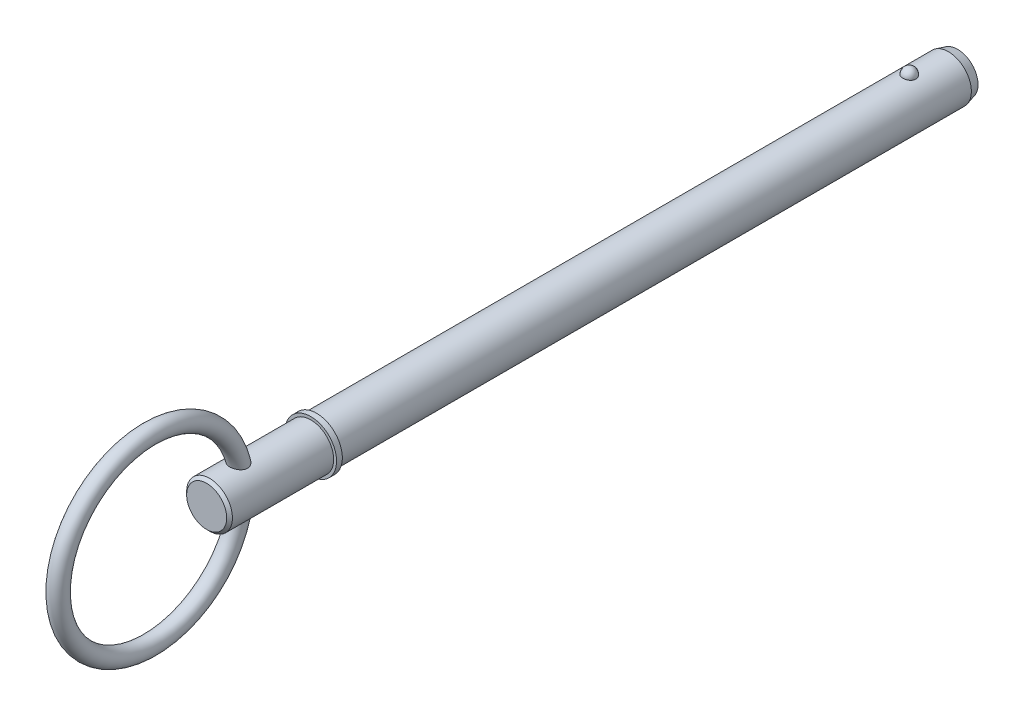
ISO-10303-21;
HEADER;
FILE_DESCRIPTION(('STEP AP214'),'2;1');
FILE_NAME('part.step','',(''),(''),'','','');
FILE_SCHEMA(('AUTOMOTIVE_DESIGN { 1 0 10303 214 1 1 1 1 }'));
ENDSEC;
DATA;
#1=APPLICATION_CONTEXT('core data for automotive mechanical design processes');
#2=APPLICATION_PROTOCOL_DEFINITION('international standard','automotive_design',2000,#1);
#3=PRODUCT_CONTEXT('',#1,'mechanical');
#4=PRODUCT('Part','Part','',(#3));
#5=PRODUCT_RELATED_PRODUCT_CATEGORY('part','',(#4));
#6=PRODUCT_DEFINITION_FORMATION('','',#4);
#7=PRODUCT_DEFINITION_CONTEXT('part definition',#1,'design');
#8=PRODUCT_DEFINITION('design','',#6,#7);
#9=PRODUCT_DEFINITION_SHAPE('','',#8);
#10=(LENGTH_UNIT() NAMED_UNIT(*) SI_UNIT(.MILLI.,.METRE.));
#11=(NAMED_UNIT(*) PLANE_ANGLE_UNIT() SI_UNIT($,.RADIAN.));
#12=(NAMED_UNIT(*) SI_UNIT($,.STERADIAN.) SOLID_ANGLE_UNIT());
#13=UNCERTAINTY_MEASURE_WITH_UNIT(LENGTH_MEASURE(1.E-05),#10,'distance_accuracy_value','');
#14=(GEOMETRIC_REPRESENTATION_CONTEXT(3) GLOBAL_UNCERTAINTY_ASSIGNED_CONTEXT((#13)) GLOBAL_UNIT_ASSIGNED_CONTEXT((#10,
#11,#12)) REPRESENTATION_CONTEXT('',''));
#15=CARTESIAN_POINT('',(0.,0.,0.));
#16=DIRECTION('',(0.,0.,1.));
#17=DIRECTION('',(1.,0.,0.));
#18=AXIS2_PLACEMENT_3D('',#15,#16,#17);
#19=CARTESIAN_POINT('',(0.,0.,101.6));
#20=DIRECTION('',(0.,0.,-1.));
#21=DIRECTION('',(-1.,0.,0.));
#22=AXIS2_PLACEMENT_3D('',#19,#20,#21);
#23=CYLINDRICAL_SURFACE('',#22,3.97);
#24=CARTESIAN_POINT('',(1.13787398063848,3.80343828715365,-1.15));
#25=CARTESIAN_POINT('',(1.13787307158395,3.80343910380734,-1.0857397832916));
#26=CARTESIAN_POINT('',(1.13264657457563,3.80501406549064,-1.02146820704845));
#27=CARTESIAN_POINT('',(1.11186534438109,3.81113760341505,-0.894749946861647));
#28=CARTESIAN_POINT('',(1.09630734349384,3.81568712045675,-0.832303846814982));
#29=CARTESIAN_POINT('',(1.05525533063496,3.82724281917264,-0.711040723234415));
#30=CARTESIAN_POINT('',(1.02976565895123,3.83424792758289,-0.652222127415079));
#31=CARTESIAN_POINT('',(0.969477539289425,3.84993235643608,-0.53981446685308));
#32=CARTESIAN_POINT('',(0.934679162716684,3.85861166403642,-0.486225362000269));
#33=CARTESIAN_POINT('',(0.856427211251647,3.87673176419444,-0.385470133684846));
#34=CARTESIAN_POINT('',(0.812928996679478,3.88617632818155,-0.338339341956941));
#35=CARTESIAN_POINT('',(0.718506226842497,3.90473543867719,-0.252134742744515));
#36=CARTESIAN_POINT('',(0.667581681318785,3.91384998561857,-0.213060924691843));
#37=CARTESIAN_POINT('',(0.559829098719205,3.93070626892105,-0.144169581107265));
#38=CARTESIAN_POINT('',(0.503019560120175,3.93845211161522,-0.114324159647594));
#39=CARTESIAN_POINT('',(0.384957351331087,3.95173781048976,-0.0645874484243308));
#40=CARTESIAN_POINT('',(0.323705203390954,3.95727792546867,-0.0446949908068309));
#41=CARTESIAN_POINT('',(0.1997490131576,3.96544869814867,-0.0157294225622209));
#42=CARTESIAN_POINT('',(0.137095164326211,3.96813298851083,-0.00645660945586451));
#43=CARTESIAN_POINT('',(0.0110617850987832,3.97048461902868,0.00167939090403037));
#44=CARTESIAN_POINT('',(-0.0523176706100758,3.97015226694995,0.000543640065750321));
#45=CARTESIAN_POINT('',(-0.176983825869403,3.96653606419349,-0.0120046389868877));
#46=CARTESIAN_POINT('',(-0.238287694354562,3.96329719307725,-0.0232605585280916));
#47=CARTESIAN_POINT('',(-0.358077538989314,3.95427494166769,-0.0555133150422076));
#48=CARTESIAN_POINT('',(-0.41656346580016,3.94849151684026,-0.0765103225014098));
#49=CARTESIAN_POINT('',(-0.529474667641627,3.9349475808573,-0.127824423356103));
#50=CARTESIAN_POINT('',(-0.583873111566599,3.92717527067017,-0.158197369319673));
#51=CARTESIAN_POINT('',(-0.686796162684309,3.9104901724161,-0.227402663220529));
#52=CARTESIAN_POINT('',(-0.735320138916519,3.90157726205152,-0.266235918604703));
#53=CARTESIAN_POINT('',(-0.826197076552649,3.88336108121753,-0.352210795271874));
#54=CARTESIAN_POINT('',(-0.868404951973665,3.87405356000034,-0.399504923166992));
#55=CARTESIAN_POINT('',(-0.944393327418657,3.85623507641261,-0.500572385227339));
#56=CARTESIAN_POINT('',(-0.978173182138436,3.84772417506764,-0.554346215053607));
#57=CARTESIAN_POINT('',(-1.036841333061,3.83233550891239,-0.667624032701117));
#58=CARTESIAN_POINT('',(-1.06161430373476,3.82547928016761,-0.727190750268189));
#59=CARTESIAN_POINT('',(-1.1010562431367,3.81431496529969,-0.849806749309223));
#60=CARTESIAN_POINT('',(-1.11572551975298,3.81000680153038,-0.912855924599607));
#61=CARTESIAN_POINT('',(-1.13455293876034,3.80444307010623,-1.04035299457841));
#62=CARTESIAN_POINT('',(-1.13875701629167,3.80317416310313,-1.10479351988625));
#63=CARTESIAN_POINT('',(-1.13668244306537,3.80379469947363,-1.23348881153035));
#64=CARTESIAN_POINT('',(-1.13040410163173,3.80568404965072,-1.29774358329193));
#65=CARTESIAN_POINT('',(-1.10758455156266,3.81238701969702,-1.42388263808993));
#66=CARTESIAN_POINT('',(-1.09109911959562,3.81718474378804,-1.48577787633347));
#67=CARTESIAN_POINT('',(-1.04831897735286,3.82915360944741,-1.6058363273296));
#68=CARTESIAN_POINT('',(-1.02202385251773,3.83632485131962,-1.66399938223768));
#69=CARTESIAN_POINT('',(-0.960087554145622,3.85229234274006,-1.77531672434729));
#70=CARTESIAN_POINT('',(-0.924393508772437,3.86109769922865,-1.82844028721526));
#71=CARTESIAN_POINT('',(-0.844617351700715,3.87932868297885,-1.92784641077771));
#72=CARTESIAN_POINT('',(-0.800534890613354,3.88875433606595,-1.97412868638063));
#73=CARTESIAN_POINT('',(-0.704909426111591,3.90722138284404,-2.05875748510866));
#74=CARTESIAN_POINT('',(-0.653336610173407,3.91626104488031,-2.09707073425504));
#75=CARTESIAN_POINT('',(-0.544251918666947,3.93290335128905,-2.16444159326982));
#76=CARTESIAN_POINT('',(-0.486740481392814,3.94050610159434,-2.19349988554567));
#77=CARTESIAN_POINT('',(-0.368186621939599,3.95333328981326,-2.24120607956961));
#78=CARTESIAN_POINT('',(-0.307200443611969,3.9585876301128,-2.25998559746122));
#79=CARTESIAN_POINT('',(-0.182787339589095,3.96627905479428,-2.28716436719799));
#80=CARTESIAN_POINT('',(-0.119360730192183,3.96871650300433,-2.29556495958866));
#81=CARTESIAN_POINT('',(0.00676344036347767,3.97048518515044,-2.30167748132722));
#82=CARTESIAN_POINT('',(0.0694499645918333,3.96987797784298,-2.299601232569));
#83=CARTESIAN_POINT('',(0.193555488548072,3.96576491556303,-2.28530777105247));
#84=CARTESIAN_POINT('',(0.254974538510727,3.96225917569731,-2.27309096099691));
#85=CARTESIAN_POINT('',(0.374550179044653,3.95274547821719,-2.2389384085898));
#86=CARTESIAN_POINT('',(0.432719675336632,3.94674835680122,-2.2170447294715));
#87=CARTESIAN_POINT('',(0.544514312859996,3.93288448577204,-2.16414952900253));
#88=CARTESIAN_POINT('',(0.598139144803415,3.92501760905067,-2.13314738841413));
#89=CARTESIAN_POINT('',(0.700284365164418,3.90809781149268,-2.06228741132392));
#90=CARTESIAN_POINT('',(0.748708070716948,3.89902775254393,-2.02229434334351));
#91=CARTESIAN_POINT('',(0.838215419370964,3.88077133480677,-1.93481443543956));
#92=CARTESIAN_POINT('',(0.879297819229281,3.87158495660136,-1.88732632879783));
#93=CARTESIAN_POINT('',(0.953804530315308,3.85391414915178,-1.78516284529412));
#94=CARTESIAN_POINT('',(0.987071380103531,3.8454460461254,-1.73036973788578));
#95=CARTESIAN_POINT('',(1.04410491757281,3.83035507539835,-1.61582422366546));
#96=CARTESIAN_POINT('',(1.06787445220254,3.82373165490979,-1.5560733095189));
#97=CARTESIAN_POINT('',(1.10358064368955,3.813570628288,-1.43904746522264));
#98=CARTESIAN_POINT('',(1.11641754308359,3.80980198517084,-1.38206535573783));
#99=CARTESIAN_POINT('',(1.13356451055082,3.80473547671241,-1.26672526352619));
#100=CARTESIAN_POINT('',(1.13787480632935,3.80343754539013,-1.20836731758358));
#101=CARTESIAN_POINT('',(1.13787398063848,3.80343828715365,-1.15));
#102=B_SPLINE_CURVE_WITH_KNOTS('',3,(#24,#25,#26,#27,#28,#29,#30,#31,#32,#33,#34,#35,#36,#37,
#38,#39,#40,#41,#42,#43,#44,#45,#46,#47,#48,#49,#50,#51,#52,#53,#54,#55,#56,#57,#58,#59,#60,#61,
#62,#63,#64,#65,#66,#67,#68,#69,#70,#71,#72,#73,#74,#75,#76,#77,#78,#79,#80,#81,#82,#83,#84,#85,
#86,#87,#88,#89,#90,#91,#92,#93,#94,#95,#96,#97,#98,#99,#100,#101),.UNSPECIFIED.,.T.,.F.,(4,2,2,
2,2,2,2,2,2,2,2,2,2,2,2,2,2,2,2,2,2,2,2,2,2,2,2,2,2,2,2,2,2,2,2,2,2,2,4),(0.,0.192571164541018,
0.385203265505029,0.577751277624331,0.770297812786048,0.963858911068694,1.15741975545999,
1.35038964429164,1.54333688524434,1.73259288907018,1.92182958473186,2.10818732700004,
2.2945483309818,2.48204164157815,2.66955507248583,2.86087083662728,3.05220124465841,
3.24590171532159,3.43959628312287,3.63243915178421,3.82527632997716,4.01706893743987,
4.20886965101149,4.40177324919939,4.59468488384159,4.78838651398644,4.9820738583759,
5.17321934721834,5.36434014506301,5.55161251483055,5.7388774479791,5.92533626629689,
6.11180776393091,6.30129785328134,6.49082000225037,6.68388392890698,6.87688993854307,
7.05180628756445,7.22671796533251),.UNSPECIFIED.);
#103=CARTESIAN_POINT('',(1.13787398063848,3.80343828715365,-1.15));
#104=VERTEX_POINT('',#103);
#105=EDGE_CURVE('E103',#104,#104,#102,.T.);
#106=ORIENTED_EDGE('',*,*,#105,.T.);
#107=EDGE_LOOP('',(#106));
#108=FACE_BOUND('',#107,.T.);
#109=CARTESIAN_POINT('',(0.,0.,-7.94399999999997));
#110=DIRECTION('',(0.,0.,-1.));
#111=DIRECTION('',(-1.,0.,0.));
#112=AXIS2_PLACEMENT_3D('',#109,#110,#111);
#113=CIRCLE('',#112,3.97);
#114=CARTESIAN_POINT('',(-3.97,0.,-7.94399999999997));
#115=VERTEX_POINT('',#114);
#116=EDGE_CURVE('E111',#115,#115,#113,.F.);
#117=ORIENTED_EDGE('',*,*,#116,.T.);
#118=EDGE_LOOP('',(#117));
#119=FACE_BOUND('',#118,.T.);
#120=CARTESIAN_POINT('',(0.,0.,101.6));
#121=DIRECTION('',(0.,0.,1.));
#122=DIRECTION('',(1.,0.,0.));
#123=AXIS2_PLACEMENT_3D('',#120,#121,#122);
#124=CIRCLE('',#123,3.97);
#125=CARTESIAN_POINT('',(3.97,0.,101.6));
#126=VERTEX_POINT('',#125);
#127=EDGE_CURVE('E109',#126,#126,#124,.T.);
#128=ORIENTED_EDGE('',*,*,#127,.F.);
#129=EDGE_LOOP('',(#128));
#130=FACE_BOUND('',#129,.T.);
#131=ADVANCED_FACE('F39',(#108,#119,#130),#23,.T.);
#132=CARTESIAN_POINT('',(0.,0.,-9.53));
#133=DIRECTION('',(0.,0.,-1.));
#134=DIRECTION('',(-1.,0.,0.));
#135=AXIS2_PLACEMENT_3D('',#132,#133,#134);
#136=PLANE('',#135);
#137=CARTESIAN_POINT('',(0.,0.,-9.53));
#138=DIRECTION('',(0.,0.,-1.));
#139=DIRECTION('',(-1.,0.,0.));
#140=AXIS2_PLACEMENT_3D('',#137,#138,#139);
#141=CIRCLE('',#140,3.54503258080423);
#142=CARTESIAN_POINT('',(-3.54503258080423,0.,-9.53));
#143=VERTEX_POINT('',#142);
#144=EDGE_CURVE('E141',#143,#143,#141,.T.);
#145=ORIENTED_EDGE('',*,*,#144,.T.);
#146=EDGE_LOOP('',(#145));
#147=FACE_BOUND('',#146,.T.);
#148=ADVANCED_FACE('F89',(#147),#136,.T.);
#149=CARTESIAN_POINT('',(0.,0.,-9.53));
#150=DIRECTION('',(0.,0.,1.));
#151=DIRECTION('',(1.,0.,0.));
#152=AXIS2_PLACEMENT_3D('',#149,#150,#151);
#153=CONICAL_SURFACE('',#152,3.54503258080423,0.26179938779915);
#154=ORIENTED_EDGE('',*,*,#116,.F.);
#155=EDGE_LOOP('',(#154));
#156=FACE_BOUND('',#155,.T.);
#157=ORIENTED_EDGE('',*,*,#144,.F.);
#158=EDGE_LOOP('',(#157));
#159=FACE_BOUND('',#158,.T.);
#160=ADVANCED_FACE('F95',(#156,#159),#153,.T.);
#161=CARTESIAN_POINT('',(0.,3.97,-1.15));
#162=DIRECTION('',(0.,1.,0.));
#163=DIRECTION('',(0.,0.,-1.));
#164=AXIS2_PLACEMENT_3D('',#161,#162,#163);
#165=SPHERICAL_SURFACE('',#164,1.15);
#166=ORIENTED_EDGE('',*,*,#105,.F.);
#167=EDGE_LOOP('',(#166));
#168=FACE_BOUND('',#167,.T.);
#169=ADVANCED_FACE('F114',(#168),#165,.T.);
#170=CARTESIAN_POINT('',(0.,0.,101.6));
#171=DIRECTION('',(0.,0.,-1.));
#172=DIRECTION('',(-1.,0.,0.));
#173=AXIS2_PLACEMENT_3D('',#170,#171,#172);
#174=PLANE('',#173);
#175=ORIENTED_EDGE('',*,*,#127,.T.);
#176=EDGE_LOOP('',(#175));
#177=FACE_BOUND('',#176,.T.);
#178=CARTESIAN_POINT('',(0.,0.,101.6));
#179=DIRECTION('',(0.,0.,-1.));
#180=DIRECTION('',(-1.,0.,0.));
#181=AXIS2_PLACEMENT_3D('',#178,#179,#180);
#182=CIRCLE('',#181,4.47);
#183=CARTESIAN_POINT('',(-4.47,0.,101.6));
#184=VERTEX_POINT('',#183);
#185=EDGE_CURVE('E110',#184,#184,#182,.T.);
#186=ORIENTED_EDGE('',*,*,#185,.T.);
#187=EDGE_LOOP('',(#186));
#188=FACE_BOUND('',#187,.T.);
#189=ADVANCED_FACE('F118',(#177,#188),#174,.T.);
#190=CARTESIAN_POINT('',(0.,0.,33.7287874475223));
#191=DIRECTION('',(0.,0.,-1.));
#192=DIRECTION('',(-1.,0.,0.));
#193=AXIS2_PLACEMENT_3D('',#190,#191,#192);
#194=CYLINDRICAL_SURFACE('',#193,4.47);
#195=CARTESIAN_POINT('',(0.,0.,102.6));
#196=DIRECTION('',(0.,0.,-1.));
#197=DIRECTION('',(-1.,0.,0.));
#198=AXIS2_PLACEMENT_3D('',#195,#196,#197);
#199=CIRCLE('',#198,4.47);
#200=CARTESIAN_POINT('',(-4.47,0.,102.6));
#201=VERTEX_POINT('',#200);
#202=EDGE_CURVE('E135',#201,#201,#199,.T.);
#203=ORIENTED_EDGE('',*,*,#202,.T.);
#204=EDGE_LOOP('',(#203));
#205=FACE_BOUND('',#204,.T.);
#206=ORIENTED_EDGE('',*,*,#185,.F.);
#207=EDGE_LOOP('',(#206));
#208=FACE_BOUND('',#207,.T.);
#209=ADVANCED_FACE('F122',(#205,#208),#194,.T.);
#210=CARTESIAN_POINT('',(0.,4.47,102.6));
#211=DIRECTION('',(0.,0.,1.));
#212=DIRECTION('',(1.,0.,0.));
#213=AXIS2_PLACEMENT_3D('',#210,#211,#212);
#214=PLANE('',#213);
#215=CARTESIAN_POINT('',(0.,0.,102.6));
#216=DIRECTION('',(0.,0.,1.));
#217=DIRECTION('',(1.,0.,0.));
#218=AXIS2_PLACEMENT_3D('',#215,#216,#217);
#219=CIRCLE('',#218,3.97);
#220=CARTESIAN_POINT('',(3.97,0.,102.6));
#221=VERTEX_POINT('',#220);
#222=EDGE_CURVE('E113',#221,#221,#219,.T.);
#223=ORIENTED_EDGE('',*,*,#222,.F.);
#224=EDGE_LOOP('',(#223));
#225=FACE_BOUND('',#224,.T.);
#226=ORIENTED_EDGE('',*,*,#202,.F.);
#227=EDGE_LOOP('',(#226));
#228=FACE_BOUND('',#227,.T.);
#229=ADVANCED_FACE('F86',(#225,#228),#214,.T.);
#230=CARTESIAN_POINT('',(0.,0.,120.65));
#231=DIRECTION('',(0.,0.,-1.));
#232=DIRECTION('',(-1.,0.,0.));
#233=AXIS2_PLACEMENT_3D('',#230,#231,#232);
#234=CYLINDRICAL_SURFACE('',#233,3.97);
#235=CARTESIAN_POINT('',(-0.740636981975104,-3.90030215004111,113.794208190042));
#236=CARTESIAN_POINT('',(-0.667733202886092,-3.91414543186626,113.754930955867));
#237=CARTESIAN_POINT('',(-0.591347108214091,-3.92651643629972,113.721598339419));
#238=CARTESIAN_POINT('',(-0.43370932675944,-3.94703799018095,113.667541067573));
#239=CARTESIAN_POINT('',(-0.352458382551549,-3.95518918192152,113.64681449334));
#240=CARTESIAN_POINT('',(-0.187320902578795,-3.96644185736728,113.618426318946));
#241=CARTESIAN_POINT('',(-0.103433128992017,-3.9695409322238,113.610770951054));
#242=CARTESIAN_POINT('',(0.064529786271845,-3.97036376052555,113.608726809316));
#243=CARTESIAN_POINT('',(0.148604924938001,-3.96808759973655,113.614337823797));
#244=CARTESIAN_POINT('',(0.313967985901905,-3.95842655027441,113.638610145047));
#245=CARTESIAN_POINT('',(0.395270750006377,-3.95107581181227,113.657184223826));
#246=CARTESIAN_POINT('',(0.553418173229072,-3.93204472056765,113.706869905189));
#247=CARTESIAN_POINT('',(0.630262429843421,-3.92036397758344,113.737982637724));
#248=CARTESIAN_POINT('',(0.777983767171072,-3.89375421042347,113.812373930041));
#249=CARTESIAN_POINT('',(0.848809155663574,-3.8788003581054,113.855746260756));
#250=CARTESIAN_POINT('',(0.981880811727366,-3.84727071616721,113.953651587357));
#251=CARTESIAN_POINT('',(1.04412630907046,-3.83069478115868,114.008185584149));
#252=CARTESIAN_POINT('',(1.15846819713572,-3.79768496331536,114.127439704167));
#253=CARTESIAN_POINT('',(1.21053047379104,-3.78125172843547,114.192192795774));
#254=CARTESIAN_POINT('',(1.30266807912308,-3.75050988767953,114.330169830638));
#255=CARTESIAN_POINT('',(1.34274789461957,-3.73620048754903,114.403390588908));
#256=CARTESIAN_POINT('',(1.40857853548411,-3.71187334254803,114.553627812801));
#257=CARTESIAN_POINT('',(1.43477198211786,-3.70172571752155,114.630429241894));
#258=CARTESIAN_POINT('',(1.47426417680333,-3.68617713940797,114.787721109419));
#259=CARTESIAN_POINT('',(1.48756557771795,-3.68077520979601,114.868210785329));
#260=CARTESIAN_POINT('',(1.5011302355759,-3.67526295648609,115.028277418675));
#261=CARTESIAN_POINT('',(1.50172918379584,-3.67501639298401,115.107822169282));
#262=CARTESIAN_POINT('',(1.4912869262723,-3.67926498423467,115.266001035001));
#263=CARTESIAN_POINT('',(1.48024221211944,-3.68376156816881,115.344634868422));
#264=CARTESIAN_POINT('',(1.44631002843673,-3.69722026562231,115.503996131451));
#265=CARTESIAN_POINT('',(1.42273446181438,-3.7064405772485,115.584553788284));
#266=CARTESIAN_POINT('',(1.36440745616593,-3.72830487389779,115.741022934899));
#267=CARTESIAN_POINT('',(1.32965006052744,-3.74095068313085,115.816931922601));
#268=CARTESIAN_POINT('',(1.244983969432,-3.77003365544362,115.971589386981));
#269=CARTESIAN_POINT('',(1.19374759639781,-3.78674477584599,116.049562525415));
#270=CARTESIAN_POINT('',(1.07927226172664,-3.82094743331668,116.196060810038));
#271=CARTESIAN_POINT('',(1.0160234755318,-3.83843960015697,116.264578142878));
#272=CARTESIAN_POINT('',(0.875824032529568,-3.87288453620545,116.392242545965));
#273=CARTESIAN_POINT('',(0.798445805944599,-3.88979192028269,116.45093750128));
#274=CARTESIAN_POINT('',(0.633271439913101,-3.92005992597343,116.552448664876));
#275=CARTESIAN_POINT('',(0.545492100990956,-3.9334261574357,116.595290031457));
#276=CARTESIAN_POINT('',(0.374503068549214,-3.9531041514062,116.657302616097));
#277=CARTESIAN_POINT('',(0.292250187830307,-3.96011991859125,116.678871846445));
#278=CARTESIAN_POINT('',(0.124887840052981,-3.96891507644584,116.705817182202));
#279=CARTESIAN_POINT('',(0.0397822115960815,-3.97070123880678,116.711214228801));
#280=CARTESIAN_POINT('',(-0.116598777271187,-3.96893737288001,116.705841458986));
#281=CARTESIAN_POINT('',(-0.187977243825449,-3.96616998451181,116.69744312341));
#282=CARTESIAN_POINT('',(-0.32822445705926,-3.95703238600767,116.66934593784));
#283=CARTESIAN_POINT('',(-0.397092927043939,-3.95066177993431,116.649645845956));
#284=CARTESIAN_POINT('',(-0.53077782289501,-3.93493622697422,116.600002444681));
#285=CARTESIAN_POINT('',(-0.595585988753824,-3.92557541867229,116.570039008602));
#286=CARTESIAN_POINT('',(-0.719890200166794,-3.904694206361,116.501221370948));
#287=CARTESIAN_POINT('',(-0.779384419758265,-3.89317306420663,116.462364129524));
#288=CARTESIAN_POINT('',(-0.900171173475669,-3.86715924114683,116.371135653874));
#289=CARTESIAN_POINT('',(-0.960570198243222,-3.85247602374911,116.317637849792));
#290=CARTESIAN_POINT('',(-1.07286582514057,-3.82272677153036,116.202437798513));
#291=CARTESIAN_POINT('',(-1.12475588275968,-3.8076604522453,116.14072930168));
#292=CARTESIAN_POINT('',(-1.22682603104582,-3.7761197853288,116.000307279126));
#293=CARTESIAN_POINT('',(-1.27547686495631,-3.75979238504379,115.920442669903));
#294=CARTESIAN_POINT('',(-1.35956460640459,-3.73021138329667,115.753453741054));
#295=CARTESIAN_POINT('',(-1.39499536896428,-3.71695921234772,115.666326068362));
#296=CARTESIAN_POINT('',(-1.45224550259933,-3.6949785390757,115.483764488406));
#297=CARTESIAN_POINT('',(-1.47355906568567,-3.68641985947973,115.388148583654));
#298=CARTESIAN_POINT('',(-1.49891316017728,-3.67618897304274,115.194306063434));
#299=CARTESIAN_POINT('',(-1.50297414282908,-3.67450861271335,115.096082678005));
#300=CARTESIAN_POINT('',(-1.49322338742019,-3.67847743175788,114.911520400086));
#301=CARTESIAN_POINT('',(-1.48132891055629,-3.68334053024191,114.825062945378));
#302=CARTESIAN_POINT('',(-1.44277978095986,-3.69860964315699,114.656020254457));
#303=CARTESIAN_POINT('',(-1.41613105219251,-3.70901343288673,114.573433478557));
#304=CARTESIAN_POINT('',(-1.35164005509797,-3.73296583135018,114.421743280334));
#305=CARTESIAN_POINT('',(-1.31494998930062,-3.74616939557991,114.352090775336));
#306=CARTESIAN_POINT('',(-1.23078033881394,-3.77465882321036,114.220114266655));
#307=CARTESIAN_POINT('',(-1.18329862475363,-3.78994509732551,114.15779171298));
#308=CARTESIAN_POINT('',(-1.07555346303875,-3.82196646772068,114.038244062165));
#309=CARTESIAN_POINT('',(-1.01467770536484,-3.83873247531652,113.98157898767));
#310=CARTESIAN_POINT('',(-0.883925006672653,-3.87093079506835,113.879334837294));
#311=CARTESIAN_POINT('',(-0.814046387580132,-3.88636285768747,113.833757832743));
#312=CARTESIAN_POINT('',(-0.740636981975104,-3.90030215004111,113.794208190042));
#313=B_SPLINE_CURVE_WITH_KNOTS('',3,(#235,#236,#237,#238,#239,#240,#241,#242,#243,#244,#245,
#246,#247,#248,#249,#250,#251,#252,#253,#254,#255,#256,#257,#258,#259,#260,#261,#262,#263,#264,
#265,#266,#267,#268,#269,#270,#271,#272,#273,#274,#275,#276,#277,#278,#279,#280,#281,#282,#283,
#284,#285,#286,#287,#288,#289,#290,#291,#292,#293,#294,#295,#296,#297,#298,#299,#300,#301,#302,
#303,#304,#305,#306,#307,#308,#309,#310,#311,#312),.UNSPECIFIED.,.T.,.F.,(4,2,2,2,2,2,2,2,2,2,2,
2,2,2,2,2,2,2,2,2,2,2,2,2,2,2,2,2,2,2,2,2,2,2,2,2,2,2,4),(0.,0.251585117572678,
0.503131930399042,0.754798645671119,1.00646134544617,1.25644674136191,1.50645467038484,
1.75842915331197,2.01042624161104,2.26325358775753,2.51598614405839,2.76008726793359,
3.00413815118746,3.24173115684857,3.47939577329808,3.7317117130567,3.9841622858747,
4.26728153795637,4.55063334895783,4.84469622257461,5.13829042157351,5.39265192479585,
5.64668391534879,5.86142364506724,6.07618697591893,6.29137389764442,6.50663447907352,
6.75172833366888,6.99700982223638,7.28055118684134,7.56422418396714,7.8575785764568,
8.15058512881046,8.41135406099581,8.67201836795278,8.91039015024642,9.14880900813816,
9.40209172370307,9.65542171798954),.UNSPECIFIED.);
#314=CARTESIAN_POINT('',(-0.740636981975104,-3.90030215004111,113.794208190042));
#315=VERTEX_POINT('',#314);
#316=EDGE_CURVE('E10',#315,#315,#313,.T.);
#317=ORIENTED_EDGE('',*,*,#316,.F.);
#318=EDGE_LOOP('',(#317));
#319=FACE_BOUND('',#318,.T.);
#320=CARTESIAN_POINT('',(-0.740636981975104,3.90030215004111,113.794208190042));
#321=CARTESIAN_POINT('',(-0.813118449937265,3.88653971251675,113.833257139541));
#322=CARTESIAN_POINT('',(-0.882149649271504,3.8713229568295,113.87817811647));
#323=CARTESIAN_POINT('',(-1.01146335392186,3.83956738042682,113.978842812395));
#324=CARTESIAN_POINT('',(-1.07174704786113,3.82302873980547,114.034585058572));
#325=CARTESIAN_POINT('',(-1.18196955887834,3.79040422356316,114.155793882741));
#326=CARTESIAN_POINT('',(-1.23189269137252,3.77431906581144,114.221274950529));
#327=CARTESIAN_POINT('',(-1.31978443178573,3.74449359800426,114.360294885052));
#328=CARTESIAN_POINT('',(-1.35775694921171,3.73075252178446,114.433831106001));
#329=CARTESIAN_POINT('',(-1.41974909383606,3.7075981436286,114.584712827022));
#330=CARTESIAN_POINT('',(-1.44413408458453,3.69807309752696,114.661891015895));
#331=CARTESIAN_POINT('',(-1.4800654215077,3.6838411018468,114.819590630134));
#332=CARTESIAN_POINT('',(-1.49161368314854,3.67913343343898,114.900111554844));
#333=CARTESIAN_POINT('',(-1.50187378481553,3.67495610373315,115.060261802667));
#334=CARTESIAN_POINT('',(-1.50086613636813,3.67537197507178,115.139870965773));
#335=CARTESIAN_POINT('',(-1.48728932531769,3.68088569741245,115.29791727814));
#336=CARTESIAN_POINT('',(-1.47471654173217,3.68598501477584,115.376354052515));
#337=CARTESIAN_POINT('',(-1.43761932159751,3.70061780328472,115.53559408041));
#338=CARTESIAN_POINT('',(-1.41233843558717,3.71042990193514,115.616194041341));
#339=CARTESIAN_POINT('',(-1.35057314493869,3.73335405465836,115.772485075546));
#340=CARTESIAN_POINT('',(-1.31408239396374,3.74646797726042,115.848173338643));
#341=CARTESIAN_POINT('',(-1.2257172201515,3.77636700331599,116.002042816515));
#342=CARTESIAN_POINT('',(-1.17251505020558,3.79340436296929,116.079416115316));
#343=CARTESIAN_POINT('',(-1.05406412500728,3.82800923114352,116.224306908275));
#344=CARTESIAN_POINT('',(-0.988806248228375,3.84557713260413,116.291816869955));
#345=CARTESIAN_POINT('',(-0.845287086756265,3.87968695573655,116.416221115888));
#346=CARTESIAN_POINT('',(-0.766724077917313,3.89618874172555,116.47278225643));
#347=CARTESIAN_POINT('',(-0.599538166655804,3.92537936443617,116.569696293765));
#348=CARTESIAN_POINT('',(-0.510933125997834,3.93807482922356,116.610077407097));
#349=CARTESIAN_POINT('',(-0.339677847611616,3.95624165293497,116.667008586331));
#350=CARTESIAN_POINT('',(-0.257968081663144,3.96248273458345,116.686128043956));
#351=CARTESIAN_POINT('',(-0.0922002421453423,3.96979198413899,116.70847364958));
#352=CARTESIAN_POINT('',(-0.00814495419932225,3.97086604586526,116.711717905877));
#353=CARTESIAN_POINT('',(0.146484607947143,3.96793776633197,116.702797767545));
#354=CARTESIAN_POINT('',(0.217212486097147,3.96466338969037,116.692843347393));
#355=CARTESIAN_POINT('',(0.355938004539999,3.95462310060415,116.66188886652));
#356=CARTESIAN_POINT('',(0.423935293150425,3.94785673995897,116.640887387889));
#357=CARTESIAN_POINT('',(0.556534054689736,3.93137424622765,116.588614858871));
#358=CARTESIAN_POINT('',(0.621075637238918,3.92161865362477,116.557205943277));
#359=CARTESIAN_POINT('',(0.744663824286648,3.90004074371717,116.48557567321));
#360=CARTESIAN_POINT('',(0.803708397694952,3.88821766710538,116.445351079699));
#361=CARTESIAN_POINT('',(0.923664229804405,3.86161149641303,116.351056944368));
#362=CARTESIAN_POINT('',(0.983622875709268,3.84664723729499,116.295828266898));
#363=CARTESIAN_POINT('',(1.09477654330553,3.816501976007,116.177194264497));
#364=CARTESIAN_POINT('',(1.14596459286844,3.80132081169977,116.11378250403));
#365=CARTESIAN_POINT('',(1.24603510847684,3.76980809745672,115.969989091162));
#366=CARTESIAN_POINT('',(1.29338223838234,3.753652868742,115.888493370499));
#367=CARTESIAN_POINT('',(1.37450267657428,3.72471527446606,115.71839607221));
#368=CARTESIAN_POINT('',(1.40827109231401,3.71193412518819,115.629791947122));
#369=CARTESIAN_POINT('',(1.46140533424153,3.6913461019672,115.44554366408));
#370=CARTESIAN_POINT('',(1.48042991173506,3.6836576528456,115.34978594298));
#371=CARTESIAN_POINT('',(1.50115029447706,3.67526750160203,115.156128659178));
#372=CARTESIAN_POINT('',(1.50286713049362,3.67455732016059,115.058231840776));
#373=CARTESIAN_POINT('',(1.48878143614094,3.68028077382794,114.875208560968));
#374=CARTESIAN_POINT('',(1.47496153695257,3.68590609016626,114.78990287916));
#375=CARTESIAN_POINT('',(1.43287242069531,3.70247002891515,114.623476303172));
#376=CARTESIAN_POINT('',(1.40460762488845,3.7134070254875,114.54235413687));
#377=CARTESIAN_POINT('',(1.33714680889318,3.7381964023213,114.393104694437));
#378=CARTESIAN_POINT('',(1.29898330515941,3.7517524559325,114.324457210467));
#379=CARTESIAN_POINT('',(1.21206000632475,3.78072797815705,114.194682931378));
#380=CARTESIAN_POINT('',(1.16329942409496,3.79614758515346,114.133556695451));
#381=CARTESIAN_POINT('',(1.05526740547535,3.82760231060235,114.018865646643));
#382=CARTESIAN_POINT('',(0.995782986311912,3.84364346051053,113.965503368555));
#383=CARTESIAN_POINT('',(0.868651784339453,3.8743538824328,113.86909984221));
#384=CARTESIAN_POINT('',(0.80100358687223,3.88902291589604,113.826060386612));
#385=CARTESIAN_POINT('',(0.656696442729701,3.91602140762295,113.749789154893));
#386=CARTESIAN_POINT('',(0.579799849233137,3.92824686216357,113.71696915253));
#387=CARTESIAN_POINT('',(0.421219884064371,3.94839960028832,113.664037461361));
#388=CARTESIAN_POINT('',(0.339536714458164,3.95632706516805,113.643925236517));
#389=CARTESIAN_POINT('',(0.173681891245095,3.96706909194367,113.616866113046));
#390=CARTESIAN_POINT('',(0.0895101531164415,3.96988347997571,113.609919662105));
#391=CARTESIAN_POINT('',(-0.0788915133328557,3.97010941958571,113.609358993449));
#392=CARTESIAN_POINT('',(-0.163121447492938,3.96752031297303,113.615746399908));
#393=CARTESIAN_POINT('',(-0.332911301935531,3.9569711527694,113.642287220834));
#394=CARTESIAN_POINT('',(-0.41836320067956,3.9487768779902,113.663041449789));
#395=CARTESIAN_POINT('',(-0.584033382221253,3.92769448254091,113.718425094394));
#396=CARTESIAN_POINT('',(-0.66425117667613,3.91480592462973,113.753055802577));
#397=CARTESIAN_POINT('',(-0.740636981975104,3.90030215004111,113.794208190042));
#398=B_SPLINE_CURVE_WITH_KNOTS('',3,(#320,#321,#322,#323,#324,#325,#326,#327,#328,#329,#330,
#331,#332,#333,#334,#335,#336,#337,#338,#339,#340,#341,#342,#343,#344,#345,#346,#347,#348,#349,
#350,#351,#352,#353,#354,#355,#356,#357,#358,#359,#360,#361,#362,#363,#364,#365,#366,#367,#368,
#369,#370,#371,#372,#373,#374,#375,#376,#377,#378,#379,#380,#381,#382,#383,#384,#385,#386,#387,
#388,#389,#390,#391,#392,#393,#394,#395,#396,#397),.UNSPECIFIED.,.T.,.F.,(4,2,2,2,2,2,2,2,2,2,2,
2,2,2,2,2,2,2,2,2,2,2,2,2,2,2,2,2,2,2,2,2,2,2,2,2,2,2,4),(0.,0.250115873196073,0.50019772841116,
0.750655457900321,1.00103116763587,1.24430196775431,1.48753646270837,1.72534678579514,
1.96323159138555,2.2173360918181,2.47158471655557,2.75662009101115,3.0418720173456,
3.33477180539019,3.62715855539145,3.87803518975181,4.12862559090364,4.34211896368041,
4.55563974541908,4.7721103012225,4.98866052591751,5.23635199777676,5.48423946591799,
5.76983687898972,6.05553710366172,6.34766729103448,6.63944246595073,6.89782349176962,
7.15612548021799,7.39414671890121,7.63218564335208,7.87561406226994,8.11908472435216,
8.37137533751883,8.62365530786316,8.87594385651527,9.12826313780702,9.39182737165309,
9.65541616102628),.UNSPECIFIED.);
#399=CARTESIAN_POINT('',(-0.740636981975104,3.90030215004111,113.794208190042));
#400=VERTEX_POINT('',#399);
#401=EDGE_CURVE('E51',#400,#400,#398,.T.);
#402=ORIENTED_EDGE('',*,*,#401,.F.);
#403=EDGE_LOOP('',(#402));
#404=FACE_BOUND('',#403,.T.);
#405=CARTESIAN_POINT('',(0.,0.,120.15));
#406=DIRECTION('',(0.,0.,-1.));
#407=DIRECTION('',(-1.,0.,0.));
#408=AXIS2_PLACEMENT_3D('',#405,#406,#407);
#409=CIRCLE('',#408,3.97);
#410=CARTESIAN_POINT('',(-3.97,0.,120.15));
#411=VERTEX_POINT('',#410);
#412=EDGE_CURVE('E65',#411,#411,#409,.T.);
#413=ORIENTED_EDGE('',*,*,#412,.T.);
#414=EDGE_LOOP('',(#413));
#415=FACE_BOUND('',#414,.T.);
#416=ORIENTED_EDGE('',*,*,#222,.T.);
#417=EDGE_LOOP('',(#416));
#418=FACE_BOUND('',#417,.T.);
#419=ADVANCED_FACE('F70',(#319,#404,#415,#418),#234,.T.);
#420=CARTESIAN_POINT('',(0.,0.,120.65));
#421=DIRECTION('',(0.,0.,-1.));
#422=DIRECTION('',(-1.,0.,0.));
#423=AXIS2_PLACEMENT_3D('',#420,#421,#422);
#424=PLANE('',#423);
#425=CARTESIAN_POINT('',(0.,0.,120.65));
#426=DIRECTION('',(0.,0.,-1.));
#427=DIRECTION('',(-1.,0.,0.));
#428=AXIS2_PLACEMENT_3D('',#425,#426,#427);
#429=CIRCLE('',#428,3.46999999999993);
#430=CARTESIAN_POINT('',(-3.46999999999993,0.,120.65));
#431=VERTEX_POINT('',#430);
#432=EDGE_CURVE('E58',#431,#431,#429,.F.);
#433=ORIENTED_EDGE('',*,*,#432,.T.);
#434=EDGE_LOOP('',(#433));
#435=FACE_BOUND('',#434,.T.);
#436=ADVANCED_FACE('F77',(#435),#424,.F.);
#437=CARTESIAN_POINT('',(0.,0.,120.15));
#438=DIRECTION('',(0.,0.,-1.));
#439=DIRECTION('',(-1.,0.,0.));
#440=AXIS2_PLACEMENT_3D('',#437,#438,#439);
#441=CONICAL_SURFACE('',#440,3.97,0.785398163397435);
#442=ORIENTED_EDGE('',*,*,#432,.F.);
#443=EDGE_LOOP('',(#442));
#444=FACE_BOUND('',#443,.T.);
#445=ORIENTED_EDGE('',*,*,#412,.F.);
#446=EDGE_LOOP('',(#445));
#447=FACE_BOUND('',#446,.T.);
#448=ADVANCED_FACE('F41',(#444,#447),#441,.T.);
#449=CARTESIAN_POINT('',(0.,0.,130.525));
#450=DIRECTION('',(1.,0.,0.));
#451=DIRECTION('',(0.,0.,-1.));
#452=AXIS2_PLACEMENT_3D('',#449,#450,#451);
#453=TOROIDAL_SURFACE('',#452,15.875,1.5);
#454=ORIENTED_EDGE('',*,*,#316,.T.);
#455=EDGE_LOOP('',(#454));
#456=FACE_BOUND('',#455,.T.);
#457=ORIENTED_EDGE('',*,*,#401,.T.);
#458=EDGE_LOOP('',(#457));
#459=FACE_BOUND('',#458,.T.);
#460=ADVANCED_FACE('F74',(#456,#459),#453,.T.);
#461=CLOSED_SHELL('',(#131,#148,#160,#169,#189,#209,#229,#419,#436,#448,#460));
#462=MANIFOLD_SOLID_BREP('B2',#461);
#463=ADVANCED_BREP_SHAPE_REPRESENTATION('',(#18,#462),#14);
#464=SHAPE_DEFINITION_REPRESENTATION(#9,#463);
ENDSEC;
END-ISO-10303-21;
